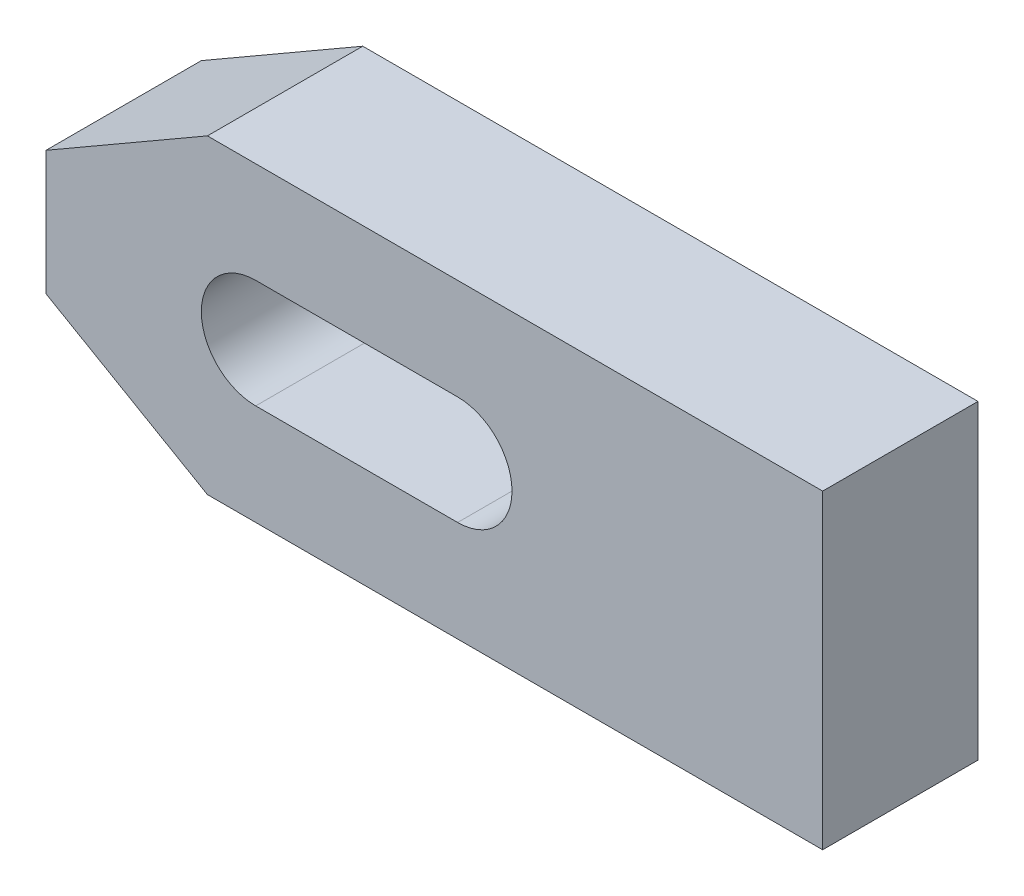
from build123d import *

# Parameters (mm, degrees)
BASE_EXTRUSION_DEPTH    = 10
ENL_V_MAT_EXTRU_2_DEPTH = 31.037476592


with BuildPart() as part:
    # Esquisse1 → Base-Extrusion (new body)
    with BuildSketch(Plane.XY):
        Polygon((-16.107695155, -10), (23.5, -10), (23.5, 10), (-16.107695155, 10), (-26.5, 4), (-26.5, -4), align=None)
    extrude(amount=BASE_EXTRUSION_DEPTH)

    # Esquisse2 → Enl_v. mat.-Extru.2 (cut, through all)
    with BuildSketch(Plane.XY):
        with BuildLine():
            Line((-13, 3.5), (0, 3.5))
            ThreePointArc((0, 3.5), (3.5, 0), (0, -3.5))
            Line((0, -3.5), (-13, -3.5))
            ThreePointArc((-13, -3.5), (-16.5, 0), (-13, 3.5))
        make_face()
    extrude(amount=ENL_V_MAT_EXTRU_2_DEPTH, mode=Mode.SUBTRACT)


solid = part.part
